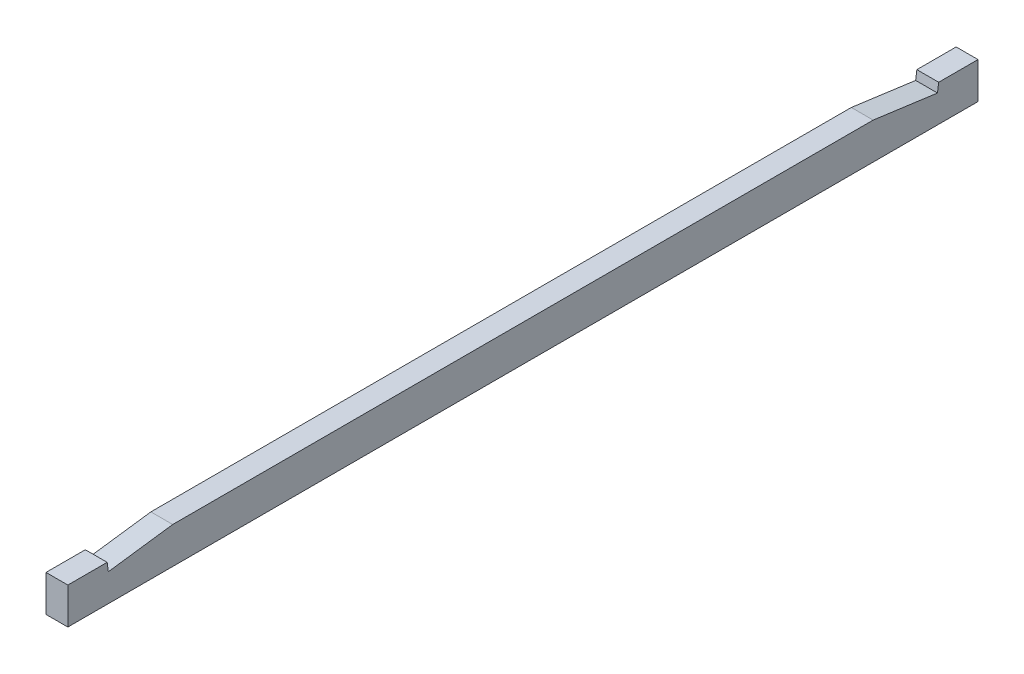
from build123d import *

# Parameters (mm, degrees)
ESQUISSE1_W             = 15
ESQUISSE1_H             = 25
EXTRUSION1_DEPTH        = 625
ENL_V_MAT_EXTRU_1_DEPTH = 626.679630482


with BuildPart() as part:
    # Esquisse1 → Extrusion1 (new body)
    with BuildSketch(Plane.XY):
        with Locations((7.5, 12.5)):
            Rectangle(ESQUISSE1_W, ESQUISSE1_H)
    extrude(amount=EXTRUSION1_DEPTH)

    # Esquisse2 → Enl_v. mat.-Extru.1 (cut, through all)
    with BuildSketch(Plane.ZY):
        Polygon((27, 25), (66.028857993, 50.822842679), (72, 25), (27.814751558, 19), align=None)
        Polygon((553, 25), (558.971142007, 50.822842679), (598, 25), (597.185248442, 19), align=None)
    extrude(amount=-ENL_V_MAT_EXTRU_1_DEPTH, mode=Mode.SUBTRACT)


solid = part.part
